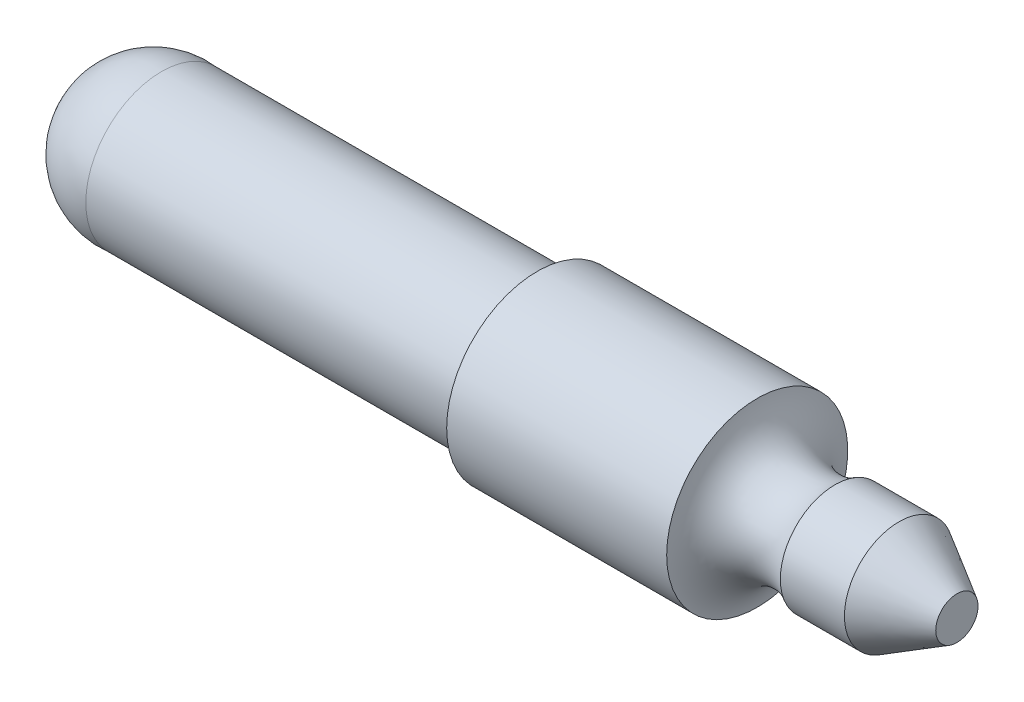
from build123d import *


with BuildPart() as part:
    # Sketch2 → Revolve1 (revolve)
    with BuildSketch(Plane.XY, mode=Mode.PRIVATE) as revolve1_sk:
        with BuildLine():
            Line((0.120315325, 1.13665), (5.759115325, 1.13665))
            Line((5.759115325, 1.13665), (5.759115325, 1.3589))
            Line((5.759115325, 1.3589), (9.061115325, 1.3589))
            ThreePointArc((9.061115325, 1.3589), (9.496361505, 0.76892504), (10.227789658, 0.81915))
            Line((10.227789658, 0.81915), (11.189432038, 0.81915))
            Line((11.189432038, 0.81915), (12.058315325, 0.3175))
            Line((12.058315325, 0.3175), (12.058315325, 0))
            Line((12.058315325, 0), (-1.143, 0))
            ThreePointArc((-1.143, 0), (-0.764502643, 0.849696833), (0.120315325, 1.13665))
        make_face()
    revolve(revolve1_sk.sketch.rotate(Axis((0, 0, 0), (1, 0, 0)), 90), axis=Axis((0, 0, 0), (1, 0, 0)))


solid = part.part
